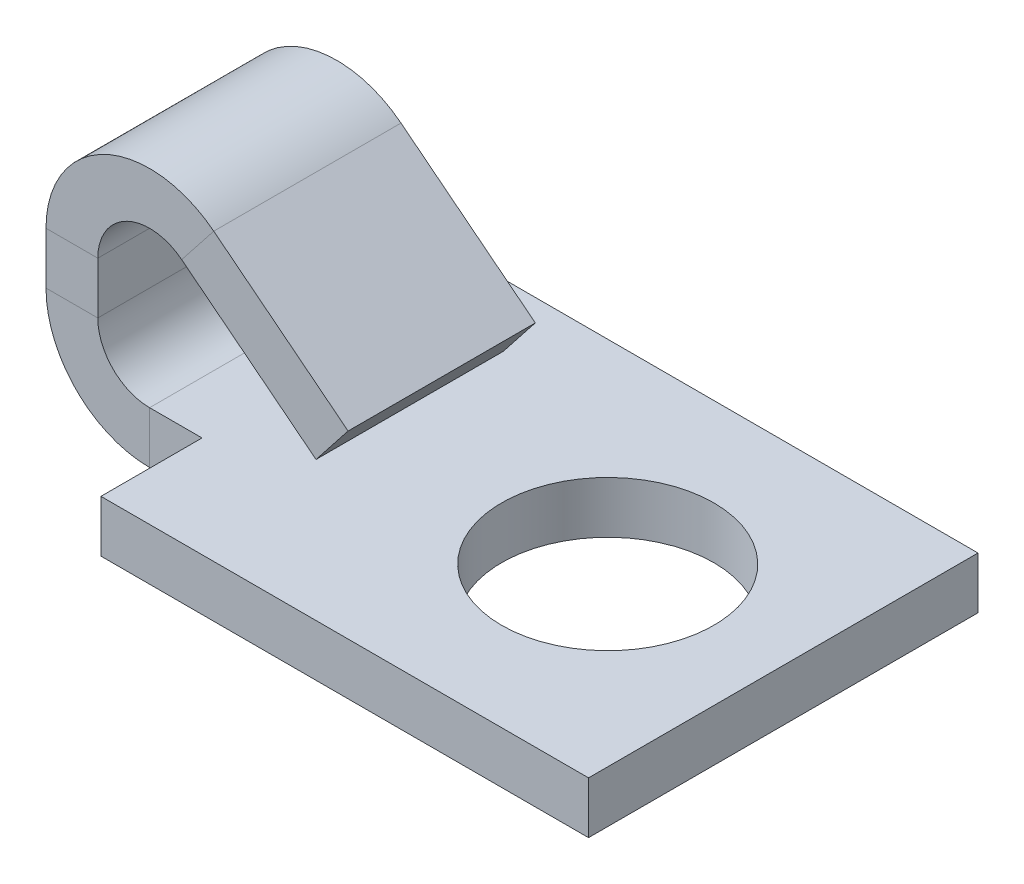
ISO-10303-21;
HEADER;
FILE_DESCRIPTION(('STEP AP214'),'2;1');
FILE_NAME('part.step','',(''),(''),'','','');
FILE_SCHEMA(('AUTOMOTIVE_DESIGN { 1 0 10303 214 1 1 1 1 }'));
ENDSEC;
DATA;
#1=APPLICATION_CONTEXT('core data for automotive mechanical design processes');
#2=APPLICATION_PROTOCOL_DEFINITION('international standard','automotive_design',2000,#1);
#3=PRODUCT_CONTEXT('',#1,'mechanical');
#4=PRODUCT('Part','Part','',(#3));
#5=PRODUCT_RELATED_PRODUCT_CATEGORY('part','',(#4));
#6=PRODUCT_DEFINITION_FORMATION('','',#4);
#7=PRODUCT_DEFINITION_CONTEXT('part definition',#1,'design');
#8=PRODUCT_DEFINITION('design','',#6,#7);
#9=PRODUCT_DEFINITION_SHAPE('','',#8);
#10=(LENGTH_UNIT() NAMED_UNIT(*) SI_UNIT(.MILLI.,.METRE.));
#11=(NAMED_UNIT(*) PLANE_ANGLE_UNIT() SI_UNIT($,.RADIAN.));
#12=(NAMED_UNIT(*) SI_UNIT($,.STERADIAN.) SOLID_ANGLE_UNIT());
#13=UNCERTAINTY_MEASURE_WITH_UNIT(LENGTH_MEASURE(1.E-05),#10,'distance_accuracy_value','');
#14=(GEOMETRIC_REPRESENTATION_CONTEXT(3) GLOBAL_UNCERTAINTY_ASSIGNED_CONTEXT((#13)) GLOBAL_UNIT_ASSIGNED_CONTEXT((#10,
#11,#12)) REPRESENTATION_CONTEXT('',''));
#15=CARTESIAN_POINT('',(0.,0.,0.));
#16=DIRECTION('',(0.,0.,1.));
#17=DIRECTION('',(1.,0.,0.));
#18=AXIS2_PLACEMENT_3D('',#15,#16,#17);
#19=CARTESIAN_POINT('',(19.05,0.,7.9248));
#20=DIRECTION('',(0.,-1.,0.));
#21=DIRECTION('',(0.,0.,-1.));
#22=AXIS2_PLACEMENT_3D('',#19,#20,#21);
#23=PLANE('',#22);
#24=DIRECTION('',(0.,0.,1.));
#25=VECTOR('',#24,1.);
#26=CARTESIAN_POINT('',(7.14375000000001,0.,-7.9248));
#27=LINE('',#26,#25);
#28=CARTESIAN_POINT('',(7.14375000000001,0.,-7.9248));
#29=VERTEX_POINT('',#28);
#30=CARTESIAN_POINT('',(7.14375000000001,0.,7.9248));
#31=VERTEX_POINT('',#30);
#32=EDGE_CURVE('E376',#29,#31,#27,.T.);
#33=ORIENTED_EDGE('',*,*,#32,.T.);
#34=DIRECTION('',(-1.,0.,0.));
#35=VECTOR('',#34,1.);
#36=CARTESIAN_POINT('',(19.05,0.,7.9248));
#37=LINE('',#36,#35);
#38=CARTESIAN_POINT('',(-12.7,0.,7.9248));
#39=VERTEX_POINT('',#38);
#40=EDGE_CURVE('E488',#31,#39,#37,.T.);
#41=ORIENTED_EDGE('',*,*,#40,.T.);
#42=DIRECTION('',(0.,0.,-1.));
#43=VECTOR('',#42,1.);
#44=CARTESIAN_POINT('',(-12.7,0.,7.9248));
#45=LINE('',#44,#43);
#46=CARTESIAN_POINT('',(-12.7,0.,3.81));
#47=VERTEX_POINT('',#46);
#48=EDGE_CURVE('E911',#39,#47,#45,.T.);
#49=ORIENTED_EDGE('',*,*,#48,.T.);
#50=DIRECTION('',(1.,0.,0.));
#51=VECTOR('',#50,1.);
#52=CARTESIAN_POINT('',(19.05,0.,3.81));
#53=LINE('',#52,#51);
#54=CARTESIAN_POINT('',(-14.8336,0.,3.81));
#55=VERTEX_POINT('',#54);
#56=EDGE_CURVE('E909',#47,#55,#53,.F.);
#57=ORIENTED_EDGE('',*,*,#56,.T.);
#58=DIRECTION('',(0.,0.,-1.));
#59=VECTOR('',#58,1.);
#60=CARTESIAN_POINT('',(-14.8336,0.,7.9248));
#61=LINE('',#60,#59);
#62=CARTESIAN_POINT('',(-14.8335999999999,0.,-3.81));
#63=VERTEX_POINT('',#62);
#64=EDGE_CURVE('E507',#55,#63,#61,.T.);
#65=ORIENTED_EDGE('',*,*,#64,.T.);
#66=DIRECTION('',(1.,0.,0.));
#67=VECTOR('',#66,1.);
#68=CARTESIAN_POINT('',(-14.8336,0.,-3.81));
#69=LINE('',#68,#67);
#70=CARTESIAN_POINT('',(-12.7,0.,-3.81000000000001));
#71=VERTEX_POINT('',#70);
#72=EDGE_CURVE('E907',#63,#71,#69,.T.);
#73=ORIENTED_EDGE('',*,*,#72,.T.);
#74=DIRECTION('',(0.,0.,-1.));
#75=VECTOR('',#74,1.);
#76=CARTESIAN_POINT('',(-12.7,0.,-7.9248));
#77=LINE('',#76,#75);
#78=CARTESIAN_POINT('',(-12.7,0.,-7.9248));
#79=VERTEX_POINT('',#78);
#80=EDGE_CURVE('E924',#71,#79,#77,.T.);
#81=ORIENTED_EDGE('',*,*,#80,.T.);
#82=DIRECTION('',(-1.,0.,0.));
#83=VECTOR('',#82,1.);
#84=CARTESIAN_POINT('',(19.05,0.,-7.9248));
#85=LINE('',#84,#83);
#86=EDGE_CURVE('E552',#29,#79,#85,.T.);
#87=ORIENTED_EDGE('',*,*,#86,.F.);
#88=EDGE_LOOP('',(#33,#41,#49,#57,#65,#73,#81,#87));
#89=FACE_BOUND('',#88,.T.);
#90=CARTESIAN_POINT('',(0.,0.,0.));
#91=DIRECTION('',(0.,1.,0.));
#92=DIRECTION('',(0.,0.,1.));
#93=AXIS2_PLACEMENT_3D('',#90,#91,#92);
#94=CIRCLE('',#93,4.318);
#95=CARTESIAN_POINT('',(0.,0.,4.318));
#96=VERTEX_POINT('',#95);
#97=EDGE_CURVE('E572',#96,#96,#94,.T.);
#98=ORIENTED_EDGE('',*,*,#97,.T.);
#99=EDGE_LOOP('',(#98));
#100=FACE_BOUND('',#99,.T.);
#101=ADVANCED_FACE('F361',(#89,#100),#23,.T.);
#102=CARTESIAN_POINT('',(19.05,2.10819999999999,7.9248));
#103=DIRECTION('',(0.,-1.,0.));
#104=DIRECTION('',(0.,0.,-1.));
#105=AXIS2_PLACEMENT_3D('',#102,#103,#104);
#106=PLANE('',#105);
#107=CARTESIAN_POINT('',(0.,2.10819999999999,0.));
#108=DIRECTION('',(0.,1.,0.));
#109=DIRECTION('',(0.,0.,1.));
#110=AXIS2_PLACEMENT_3D('',#107,#108,#109);
#111=CIRCLE('',#110,4.318);
#112=CARTESIAN_POINT('',(0.,2.10819999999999,4.318));
#113=VERTEX_POINT('',#112);
#114=EDGE_CURVE('E575',#113,#113,#111,.T.);
#115=ORIENTED_EDGE('',*,*,#114,.F.);
#116=EDGE_LOOP('',(#115));
#117=FACE_BOUND('',#116,.T.);
#118=DIRECTION('',(0.,0.,-1.));
#119=VECTOR('',#118,1.);
#120=CARTESIAN_POINT('',(-12.7,2.10819999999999,7.9248));
#121=LINE('',#120,#119);
#122=CARTESIAN_POINT('',(-12.7,2.10819999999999,7.9248));
#123=VERTEX_POINT('',#122);
#124=CARTESIAN_POINT('',(-12.7,2.10819999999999,3.81));
#125=VERTEX_POINT('',#124);
#126=EDGE_CURVE('E493',#123,#125,#121,.T.);
#127=ORIENTED_EDGE('',*,*,#126,.F.);
#128=DIRECTION('',(1.,0.,0.));
#129=VECTOR('',#128,1.);
#130=CARTESIAN_POINT('',(19.05,2.10819999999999,7.9248));
#131=LINE('',#130,#129);
#132=CARTESIAN_POINT('',(7.14375000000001,2.10819999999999,7.9248));
#133=VERTEX_POINT('',#132);
#134=EDGE_CURVE('E486',#133,#123,#131,.F.);
#135=ORIENTED_EDGE('',*,*,#134,.F.);
#136=DIRECTION('',(0.,0.,1.));
#137=VECTOR('',#136,1.);
#138=CARTESIAN_POINT('',(7.14375000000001,2.10819999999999,-7.9248));
#139=LINE('',#138,#137);
#140=CARTESIAN_POINT('',(7.14375000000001,2.10819999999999,-7.9248));
#141=VERTEX_POINT('',#140);
#142=EDGE_CURVE('E473',#141,#133,#139,.T.);
#143=ORIENTED_EDGE('',*,*,#142,.F.);
#144=DIRECTION('',(1.,0.,0.));
#145=VECTOR('',#144,1.);
#146=CARTESIAN_POINT('',(19.05,2.10819999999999,-7.9248));
#147=LINE('',#146,#145);
#148=CARTESIAN_POINT('',(-12.7,2.10819999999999,-7.9248));
#149=VERTEX_POINT('',#148);
#150=EDGE_CURVE('E497',#141,#149,#147,.F.);
#151=ORIENTED_EDGE('',*,*,#150,.T.);
#152=DIRECTION('',(0.,0.,-1.));
#153=VECTOR('',#152,1.);
#154=CARTESIAN_POINT('',(-12.7,2.10819999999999,7.9248));
#155=LINE('',#154,#153);
#156=CARTESIAN_POINT('',(-12.7,2.10819999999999,-3.81000000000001));
#157=VERTEX_POINT('',#156);
#158=EDGE_CURVE('E558',#157,#149,#155,.T.);
#159=ORIENTED_EDGE('',*,*,#158,.F.);
#160=DIRECTION('',(1.,0.,0.));
#161=VECTOR('',#160,1.);
#162=CARTESIAN_POINT('',(19.05,2.10819999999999,-3.81));
#163=LINE('',#162,#161);
#164=CARTESIAN_POINT('',(-14.8335999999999,2.10819999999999,-3.81));
#165=VERTEX_POINT('',#164);
#166=EDGE_CURVE('E569',#165,#157,#163,.T.);
#167=ORIENTED_EDGE('',*,*,#166,.F.);
#168=DIRECTION('',(0.,0.,-1.));
#169=VECTOR('',#168,1.);
#170=CARTESIAN_POINT('',(-14.8336,2.10819999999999,7.9248));
#171=LINE('',#170,#169);
#172=CARTESIAN_POINT('',(-14.8336,2.10819999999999,3.81));
#173=VERTEX_POINT('',#172);
#174=EDGE_CURVE('E504',#173,#165,#171,.T.);
#175=ORIENTED_EDGE('',*,*,#174,.F.);
#176=DIRECTION('',(-1.,0.,0.));
#177=VECTOR('',#176,1.);
#178=CARTESIAN_POINT('',(-14.8336,2.10819999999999,3.81000000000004));
#179=LINE('',#178,#177);
#180=EDGE_CURVE('E918',#125,#173,#179,.T.);
#181=ORIENTED_EDGE('',*,*,#180,.F.);
#182=EDGE_LOOP('',(#127,#135,#143,#151,#159,#167,#175,#181));
#183=FACE_BOUND('',#182,.T.);
#184=ADVANCED_FACE('F491',(#117,#183),#106,.F.);
#185=CARTESIAN_POINT('',(16.9418,4.21639999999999,7.9248));
#186=DIRECTION('',(0.,0.,1.));
#187=DIRECTION('',(1.,0.,0.));
#188=AXIS2_PLACEMENT_3D('',#185,#186,#187);
#189=PLANE('',#188);
#190=DIRECTION('',(0.,-1.,0.));
#191=VECTOR('',#190,1.);
#192=CARTESIAN_POINT('',(7.14375000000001,0.,7.9248));
#193=LINE('',#192,#191);
#194=EDGE_CURVE('E476',#133,#31,#193,.T.);
#195=ORIENTED_EDGE('',*,*,#194,.F.);
#196=ORIENTED_EDGE('',*,*,#134,.T.);
#197=DIRECTION('',(0.,1.,0.));
#198=VECTOR('',#197,1.);
#199=CARTESIAN_POINT('',(-12.7,2.10819999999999,7.9248));
#200=LINE('',#199,#198);
#201=EDGE_CURVE('E916',#123,#39,#200,.F.);
#202=ORIENTED_EDGE('',*,*,#201,.T.);
#203=ORIENTED_EDGE('',*,*,#40,.F.);
#204=EDGE_LOOP('',(#195,#196,#202,#203));
#205=FACE_BOUND('',#204,.T.);
#206=ADVANCED_FACE('F484',(#205),#189,.T.);
#207=CARTESIAN_POINT('',(-16.9418,4.21639999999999,-7.9248));
#208=DIRECTION('',(0.,0.,-1.));
#209=DIRECTION('',(-1.,0.,0.));
#210=AXIS2_PLACEMENT_3D('',#207,#208,#209);
#211=PLANE('',#210);
#212=DIRECTION('',(0.,-1.,0.));
#213=VECTOR('',#212,1.);
#214=CARTESIAN_POINT('',(7.14375000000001,0.,-7.9248));
#215=LINE('',#214,#213);
#216=EDGE_CURVE('E477',#141,#29,#215,.T.);
#217=ORIENTED_EDGE('',*,*,#216,.T.);
#218=ORIENTED_EDGE('',*,*,#86,.T.);
#219=DIRECTION('',(0.,-1.,0.));
#220=VECTOR('',#219,1.);
#221=CARTESIAN_POINT('',(-12.7,0.,-7.9248));
#222=LINE('',#221,#220);
#223=EDGE_CURVE('E565',#79,#149,#222,.F.);
#224=ORIENTED_EDGE('',*,*,#223,.T.);
#225=ORIENTED_EDGE('',*,*,#150,.F.);
#226=EDGE_LOOP('',(#217,#218,#224,#225));
#227=FACE_BOUND('',#226,.T.);
#228=ADVANCED_FACE('F363',(#227),#211,.T.);
#229=CARTESIAN_POINT('',(-20.355268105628,13.3616349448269,7.9248));
#230=DIRECTION('',(0.619138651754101,0.785281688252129,0.));
#231=DIRECTION('',(-0.785281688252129,0.619138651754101,0.));
#232=AXIS2_PLACEMENT_3D('',#229,#230,#231);
#233=PLANE('',#232);
#234=DIRECTION('',(-0.785281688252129,0.619138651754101,0.));
#235=VECTOR('',#234,1.);
#236=CARTESIAN_POINT('',(-20.355268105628,13.3616349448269,3.81));
#237=LINE('',#236,#235);
#238=CARTESIAN_POINT('',(-13.528331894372,7.97908223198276,3.81));
#239=VERTEX_POINT('',#238);
#240=CARTESIAN_POINT('',(-8.06166810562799,3.66900739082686,3.81));
#241=VERTEX_POINT('',#240);
#242=EDGE_CURVE('E594',#239,#241,#237,.F.);
#243=ORIENTED_EDGE('',*,*,#242,.F.);
#244=DIRECTION('',(0.,0.,-1.));
#245=VECTOR('',#244,1.);
#246=CARTESIAN_POINT('',(-13.528331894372,7.97908223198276,7.9248));
#247=LINE('',#246,#245);
#248=CARTESIAN_POINT('',(-13.528331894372,7.97908223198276,-3.81));
#249=VERTEX_POINT('',#248);
#250=EDGE_CURVE('E384',#239,#249,#247,.T.);
#251=ORIENTED_EDGE('',*,*,#250,.T.);
#252=DIRECTION('',(-0.785281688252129,0.619138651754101,0.));
#253=VECTOR('',#252,1.);
#254=CARTESIAN_POINT('',(-20.355268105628,13.3616349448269,-3.81));
#255=LINE('',#254,#253);
#256=CARTESIAN_POINT('',(-8.06166810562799,3.66900739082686,-3.81));
#257=VERTEX_POINT('',#256);
#258=EDGE_CURVE('E535',#257,#249,#255,.T.);
#259=ORIENTED_EDGE('',*,*,#258,.F.);
#260=DIRECTION('',(0.,0.,-1.));
#261=VECTOR('',#260,1.);
#262=CARTESIAN_POINT('',(-8.06166810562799,3.66900739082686,7.9248));
#263=LINE('',#262,#261);
#264=EDGE_CURVE('E11',#241,#257,#263,.T.);
#265=ORIENTED_EDGE('',*,*,#264,.F.);
#266=EDGE_LOOP('',(#243,#251,#259,#265));
#267=FACE_BOUND('',#266,.T.);
#268=ADVANCED_FACE('F664',(#267),#233,.F.);
#269=CARTESIAN_POINT('',(-6.7564,5.324538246,7.9248));
#270=DIRECTION('',(0.78528168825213,-0.6191386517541,0.));
#271=DIRECTION('',(0.6191386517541,0.78528168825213,0.));
#272=AXIS2_PLACEMENT_3D('',#269,#270,#271);
#273=PLANE('',#272);
#274=DIRECTION('',(0.,0.,-1.));
#275=VECTOR('',#274,1.);
#276=CARTESIAN_POINT('',(-6.7564,5.324538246,7.9248));
#277=LINE('',#276,#275);
#278=CARTESIAN_POINT('',(-6.7564,5.324538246,3.81));
#279=VERTEX_POINT('',#278);
#280=CARTESIAN_POINT('',(-6.75639999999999,5.32453824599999,-3.81000000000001));
#281=VERTEX_POINT('',#280);
#282=EDGE_CURVE('E369',#279,#281,#277,.T.);
#283=ORIENTED_EDGE('',*,*,#282,.F.);
#284=DIRECTION('',(0.619138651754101,0.785281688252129,0.));
#285=VECTOR('',#284,1.);
#286=CARTESIAN_POINT('',(-6.7564,5.324538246,3.81));
#287=LINE('',#286,#285);
#288=EDGE_CURVE('E597',#279,#241,#287,.F.);
#289=ORIENTED_EDGE('',*,*,#288,.T.);
#290=ORIENTED_EDGE('',*,*,#264,.T.);
#291=DIRECTION('',(-0.619138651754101,-0.785281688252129,0.));
#292=VECTOR('',#291,1.);
#293=CARTESIAN_POINT('',(-8.06166810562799,3.66900739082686,-3.81));
#294=LINE('',#293,#292);
#295=EDGE_CURVE('E533',#257,#281,#294,.F.);
#296=ORIENTED_EDGE('',*,*,#295,.T.);
#297=EDGE_LOOP('',(#283,#289,#290,#296));
#298=FACE_BOUND('',#297,.T.);
#299=ADVANCED_FACE('F537',(#298),#273,.T.);
#300=CARTESIAN_POINT('',(-19.05,15.0171658,7.9248));
#301=DIRECTION('',(0.619138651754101,0.785281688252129,0.));
#302=DIRECTION('',(-0.785281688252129,0.619138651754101,0.));
#303=AXIS2_PLACEMENT_3D('',#300,#301,#302);
#304=PLANE('',#303);
#305=DIRECTION('',(0.,0.,-1.));
#306=VECTOR('',#305,1.);
#307=CARTESIAN_POINT('',(-12.223063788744,9.6346130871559,7.9248));
#308=LINE('',#307,#306);
#309=CARTESIAN_POINT('',(-12.223063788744,9.6346130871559,3.81));
#310=VERTEX_POINT('',#309);
#311=CARTESIAN_POINT('',(-12.223063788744,9.63461308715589,-3.81));
#312=VERTEX_POINT('',#311);
#313=EDGE_CURVE('E514',#310,#312,#308,.T.);
#314=ORIENTED_EDGE('',*,*,#313,.F.);
#315=DIRECTION('',(0.785281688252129,-0.619138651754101,0.));
#316=VECTOR('',#315,1.);
#317=CARTESIAN_POINT('',(-19.05,15.0171658,3.81));
#318=LINE('',#317,#316);
#319=EDGE_CURVE('E524',#310,#279,#318,.T.);
#320=ORIENTED_EDGE('',*,*,#319,.T.);
#321=ORIENTED_EDGE('',*,*,#282,.T.);
#322=DIRECTION('',(-0.785281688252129,0.619138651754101,0.));
#323=VECTOR('',#322,1.);
#324=CARTESIAN_POINT('',(-19.05,15.0171658,-3.81000000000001));
#325=LINE('',#324,#323);
#326=EDGE_CURVE('E522',#281,#312,#325,.T.);
#327=ORIENTED_EDGE('',*,*,#326,.T.);
#328=EDGE_LOOP('',(#314,#320,#321,#327));
#329=FACE_BOUND('',#328,.T.);
#330=ADVANCED_FACE('F521',(#329),#304,.T.);
#331=CARTESIAN_POINT('',(-14.8336,6.32355137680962,7.9248));
#332=DIRECTION('',(0.,0.,-1.));
#333=DIRECTION('',(-1.,0.,0.));
#334=AXIS2_PLACEMENT_3D('',#331,#332,#333);
#335=CYLINDRICAL_SURFACE('',#334,4.2164);
#336=DIRECTION('',(0.,0.,-1.));
#337=VECTOR('',#336,1.);
#338=CARTESIAN_POINT('',(-19.05,6.32355137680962,7.9248));
#339=LINE('',#338,#337);
#340=CARTESIAN_POINT('',(-19.05,6.32355137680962,3.81));
#341=VERTEX_POINT('',#340);
#342=CARTESIAN_POINT('',(-19.05,6.32355137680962,-3.81));
#343=VERTEX_POINT('',#342);
#344=EDGE_CURVE('E512',#341,#343,#339,.T.);
#345=ORIENTED_EDGE('',*,*,#344,.F.);
#346=CARTESIAN_POINT('',(-14.8336,6.32355137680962,3.81));
#347=DIRECTION('',(0.,0.,1.));
#348=DIRECTION('',(1.,0.,0.));
#349=AXIS2_PLACEMENT_3D('',#346,#347,#348);
#350=CIRCLE('',#349,4.2164);
#351=EDGE_CURVE('E588',#341,#310,#350,.F.);
#352=ORIENTED_EDGE('',*,*,#351,.T.);
#353=ORIENTED_EDGE('',*,*,#313,.T.);
#354=CARTESIAN_POINT('',(-14.8336,6.32355137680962,-3.81));
#355=DIRECTION('',(0.,0.,-1.));
#356=DIRECTION('',(-1.,0.,0.));
#357=AXIS2_PLACEMENT_3D('',#354,#355,#356);
#358=CIRCLE('',#357,4.2164);
#359=EDGE_CURVE('E624',#312,#343,#358,.F.);
#360=ORIENTED_EDGE('',*,*,#359,.T.);
#361=EDGE_LOOP('',(#345,#352,#353,#360));
#362=FACE_BOUND('',#361,.T.);
#363=ADVANCED_FACE('F658',(#362),#335,.T.);
#364=CARTESIAN_POINT('',(-19.05,0.,7.9248));
#365=DIRECTION('',(-1.,0.,0.));
#366=DIRECTION('',(0.,0.,1.));
#367=AXIS2_PLACEMENT_3D('',#364,#365,#366);
#368=PLANE('',#367);
#369=DIRECTION('',(0.,0.,-1.));
#370=VECTOR('',#369,1.);
#371=CARTESIAN_POINT('',(-19.05,4.21639999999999,7.9248));
#372=LINE('',#371,#370);
#373=CARTESIAN_POINT('',(-19.05,4.21639999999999,3.81));
#374=VERTEX_POINT('',#373);
#375=CARTESIAN_POINT('',(-19.05,4.21639999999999,-3.81));
#376=VERTEX_POINT('',#375);
#377=EDGE_CURVE('E510',#374,#376,#372,.T.);
#378=ORIENTED_EDGE('',*,*,#377,.F.);
#379=DIRECTION('',(0.,-1.,0.));
#380=VECTOR('',#379,1.);
#381=CARTESIAN_POINT('',(-19.05,10.5399513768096,3.81));
#382=LINE('',#381,#380);
#383=EDGE_CURVE('E599',#341,#374,#382,.T.);
#384=ORIENTED_EDGE('',*,*,#383,.F.);
#385=ORIENTED_EDGE('',*,*,#344,.T.);
#386=DIRECTION('',(0.,-1.,0.));
#387=VECTOR('',#386,1.);
#388=CARTESIAN_POINT('',(-19.05,10.5399513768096,-3.81));
#389=LINE('',#388,#387);
#390=EDGE_CURVE('E540',#343,#376,#389,.T.);
#391=ORIENTED_EDGE('',*,*,#390,.T.);
#392=EDGE_LOOP('',(#378,#384,#385,#391));
#393=FACE_BOUND('',#392,.T.);
#394=ADVANCED_FACE('F654',(#393),#368,.T.);
#395=CARTESIAN_POINT('',(-14.8336,4.21639999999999,7.9248));
#396=DIRECTION('',(0.,0.,-1.));
#397=DIRECTION('',(-1.,0.,0.));
#398=AXIS2_PLACEMENT_3D('',#395,#396,#397);
#399=CYLINDRICAL_SURFACE('',#398,4.2164);
#400=ORIENTED_EDGE('',*,*,#64,.F.);
#401=CARTESIAN_POINT('',(-14.8336,4.21639999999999,3.81));
#402=DIRECTION('',(0.,0.,1.));
#403=DIRECTION('',(1.,0.,0.));
#404=AXIS2_PLACEMENT_3D('',#401,#402,#403);
#405=CIRCLE('',#404,4.2164);
#406=EDGE_CURVE('E583',#55,#374,#405,.F.);
#407=ORIENTED_EDGE('',*,*,#406,.T.);
#408=ORIENTED_EDGE('',*,*,#377,.T.);
#409=CARTESIAN_POINT('',(-14.8336,4.21639999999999,-3.81));
#410=DIRECTION('',(0.,0.,-1.));
#411=DIRECTION('',(-1.,0.,0.));
#412=AXIS2_PLACEMENT_3D('',#409,#410,#411);
#413=CIRCLE('',#412,4.2164);
#414=EDGE_CURVE('E615',#376,#63,#413,.F.);
#415=ORIENTED_EDGE('',*,*,#414,.T.);
#416=EDGE_LOOP('',(#400,#407,#408,#415));
#417=FACE_BOUND('',#416,.T.);
#418=ADVANCED_FACE('F686',(#417),#399,.T.);
#419=CARTESIAN_POINT('',(-14.8336,4.21639999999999,7.9248));
#420=DIRECTION('',(0.,0.,-1.));
#421=DIRECTION('',(-1.,0.,0.));
#422=AXIS2_PLACEMENT_3D('',#419,#420,#421);
#423=CYLINDRICAL_SURFACE('',#422,2.1082);
#424=CARTESIAN_POINT('',(-14.8336,4.21639999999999,3.81));
#425=DIRECTION('',(0.,0.,-1.));
#426=DIRECTION('',(-1.,0.,0.));
#427=AXIS2_PLACEMENT_3D('',#424,#425,#426);
#428=CIRCLE('',#427,2.1082);
#429=CARTESIAN_POINT('',(-16.9418,4.21639999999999,3.81));
#430=VERTEX_POINT('',#429);
#431=EDGE_CURVE('E586',#173,#430,#428,.T.);
#432=ORIENTED_EDGE('',*,*,#431,.F.);
#433=ORIENTED_EDGE('',*,*,#174,.T.);
#434=CARTESIAN_POINT('',(-14.8336,4.21639999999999,-3.81));
#435=DIRECTION('',(0.,0.,-1.));
#436=DIRECTION('',(-1.,0.,0.));
#437=AXIS2_PLACEMENT_3D('',#434,#435,#436);
#438=CIRCLE('',#437,2.1082);
#439=CARTESIAN_POINT('',(-16.9418,4.21639999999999,-3.81));
#440=VERTEX_POINT('',#439);
#441=EDGE_CURVE('E618',#440,#165,#438,.F.);
#442=ORIENTED_EDGE('',*,*,#441,.F.);
#443=DIRECTION('',(0.,0.,-1.));
#444=VECTOR('',#443,1.);
#445=CARTESIAN_POINT('',(-16.9418,4.21639999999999,7.9248));
#446=LINE('',#445,#444);
#447=EDGE_CURVE('E502',#430,#440,#446,.T.);
#448=ORIENTED_EDGE('',*,*,#447,.F.);
#449=EDGE_LOOP('',(#432,#433,#442,#448));
#450=FACE_BOUND('',#449,.T.);
#451=ADVANCED_FACE('F647',(#450),#423,.F.);
#452=CARTESIAN_POINT('',(-16.9418,0.,7.9248));
#453=DIRECTION('',(-1.,0.,0.));
#454=DIRECTION('',(0.,0.,1.));
#455=AXIS2_PLACEMENT_3D('',#452,#453,#454);
#456=PLANE('',#455);
#457=DIRECTION('',(0.,1.,0.));
#458=VECTOR('',#457,1.);
#459=CARTESIAN_POINT('',(-16.9418,0.,3.81));
#460=LINE('',#459,#458);
#461=CARTESIAN_POINT('',(-16.9418,6.32355137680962,3.81));
#462=VERTEX_POINT('',#461);
#463=EDGE_CURVE('E603',#462,#430,#460,.F.);
#464=ORIENTED_EDGE('',*,*,#463,.T.);
#465=ORIENTED_EDGE('',*,*,#447,.T.);
#466=DIRECTION('',(0.,1.,0.));
#467=VECTOR('',#466,1.);
#468=CARTESIAN_POINT('',(-16.9418,0.,-3.81));
#469=LINE('',#468,#467);
#470=CARTESIAN_POINT('',(-16.9418,6.32355137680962,-3.81));
#471=VERTEX_POINT('',#470);
#472=EDGE_CURVE('E545',#471,#440,#469,.F.);
#473=ORIENTED_EDGE('',*,*,#472,.F.);
#474=DIRECTION('',(0.,0.,-1.));
#475=VECTOR('',#474,1.);
#476=CARTESIAN_POINT('',(-16.9418,6.32355137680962,7.9248));
#477=LINE('',#476,#475);
#478=EDGE_CURVE('E495',#462,#471,#477,.T.);
#479=ORIENTED_EDGE('',*,*,#478,.F.);
#480=EDGE_LOOP('',(#464,#465,#473,#479));
#481=FACE_BOUND('',#480,.T.);
#482=ADVANCED_FACE('F642',(#481),#456,.F.);
#483=CARTESIAN_POINT('',(-14.8336,6.32355137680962,7.9248));
#484=DIRECTION('',(0.,0.,-1.));
#485=DIRECTION('',(-1.,0.,0.));
#486=AXIS2_PLACEMENT_3D('',#483,#484,#485);
#487=CYLINDRICAL_SURFACE('',#486,2.1082);
#488=CARTESIAN_POINT('',(-14.8336,6.32355137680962,3.81));
#489=DIRECTION('',(0.,0.,-1.));
#490=DIRECTION('',(-1.,0.,0.));
#491=AXIS2_PLACEMENT_3D('',#488,#489,#490);
#492=CIRCLE('',#491,2.1082);
#493=EDGE_CURVE('E591',#462,#239,#492,.T.);
#494=ORIENTED_EDGE('',*,*,#493,.F.);
#495=ORIENTED_EDGE('',*,*,#478,.T.);
#496=CARTESIAN_POINT('',(-14.8336,6.32355137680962,-3.81));
#497=DIRECTION('',(0.,0.,-1.));
#498=DIRECTION('',(-1.,0.,0.));
#499=AXIS2_PLACEMENT_3D('',#496,#497,#498);
#500=CIRCLE('',#499,2.1082);
#501=EDGE_CURVE('E621',#249,#471,#500,.F.);
#502=ORIENTED_EDGE('',*,*,#501,.F.);
#503=ORIENTED_EDGE('',*,*,#250,.F.);
#504=EDGE_LOOP('',(#494,#495,#502,#503));
#505=FACE_BOUND('',#504,.T.);
#506=ADVANCED_FACE('F630',(#505),#487,.F.);
#507=CARTESIAN_POINT('',(-19.05,10.5399513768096,-3.81));
#508=DIRECTION('',(0.,0.,-1.));
#509=DIRECTION('',(0.,-1.,0.));
#510=AXIS2_PLACEMENT_3D('',#507,#508,#509);
#511=PLANE('',#510);
#512=DIRECTION('',(-1.,0.,0.));
#513=VECTOR('',#512,1.);
#514=CARTESIAN_POINT('',(-19.05,4.21639999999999,-3.81));
#515=LINE('',#514,#513);
#516=EDGE_CURVE('E549',#376,#440,#515,.F.);
#517=ORIENTED_EDGE('',*,*,#516,.F.);
#518=ORIENTED_EDGE('',*,*,#390,.F.);
#519=DIRECTION('',(-1.,0.,0.));
#520=VECTOR('',#519,1.);
#521=CARTESIAN_POINT('',(-19.05,6.32355137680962,-3.81));
#522=LINE('',#521,#520);
#523=EDGE_CURVE('E548',#343,#471,#522,.F.);
#524=ORIENTED_EDGE('',*,*,#523,.T.);
#525=ORIENTED_EDGE('',*,*,#472,.T.);
#526=EDGE_LOOP('',(#517,#518,#524,#525));
#527=FACE_BOUND('',#526,.T.);
#528=ADVANCED_FACE('F640',(#527),#511,.T.);
#529=CARTESIAN_POINT('',(-20.355268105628,13.3616349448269,-3.81));
#530=DIRECTION('',(0.,0.,-1.));
#531=DIRECTION('',(-0.785281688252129,0.619138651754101,0.));
#532=AXIS2_PLACEMENT_3D('',#529,#530,#531);
#533=PLANE('',#532);
#534=ORIENTED_EDGE('',*,*,#258,.T.);
#535=DIRECTION('',(-0.619138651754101,-0.785281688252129,0.));
#536=VECTOR('',#535,1.);
#537=CARTESIAN_POINT('',(-13.528331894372,7.97908223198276,-3.81));
#538=LINE('',#537,#536);
#539=EDGE_CURVE('E534',#249,#312,#538,.F.);
#540=ORIENTED_EDGE('',*,*,#539,.T.);
#541=ORIENTED_EDGE('',*,*,#326,.F.);
#542=ORIENTED_EDGE('',*,*,#295,.F.);
#543=EDGE_LOOP('',(#534,#540,#541,#542));
#544=FACE_BOUND('',#543,.T.);
#545=ADVANCED_FACE('F532',(#544),#533,.T.);
#546=CARTESIAN_POINT('',(-14.8336,6.32355137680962,-3.81));
#547=DIRECTION('',(0.,0.,1.));
#548=DIRECTION('',(1.,0.,0.));
#549=AXIS2_PLACEMENT_3D('',#546,#547,#548);
#550=PLANE('',#549);
#551=ORIENTED_EDGE('',*,*,#501,.T.);
#552=ORIENTED_EDGE('',*,*,#523,.F.);
#553=ORIENTED_EDGE('',*,*,#359,.F.);
#554=ORIENTED_EDGE('',*,*,#539,.F.);
#555=EDGE_LOOP('',(#551,#552,#553,#554));
#556=FACE_BOUND('',#555,.T.);
#557=ADVANCED_FACE('F634',(#556),#550,.F.);
#558=CARTESIAN_POINT('',(-14.8336,4.21639999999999,-3.81));
#559=DIRECTION('',(0.,0.,1.));
#560=DIRECTION('',(1.,0.,0.));
#561=AXIS2_PLACEMENT_3D('',#558,#559,#560);
#562=PLANE('',#561);
#563=ORIENTED_EDGE('',*,*,#414,.F.);
#564=ORIENTED_EDGE('',*,*,#516,.T.);
#565=ORIENTED_EDGE('',*,*,#441,.T.);
#566=DIRECTION('',(0.,1.,0.));
#567=VECTOR('',#566,1.);
#568=CARTESIAN_POINT('',(-14.8336,2.10819999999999,-3.81));
#569=LINE('',#568,#567);
#570=EDGE_CURVE('E610',#165,#63,#569,.F.);
#571=ORIENTED_EDGE('',*,*,#570,.T.);
#572=EDGE_LOOP('',(#563,#564,#565,#571));
#573=FACE_BOUND('',#572,.T.);
#574=ADVANCED_FACE('F651',(#573),#562,.F.);
#575=CARTESIAN_POINT('',(-19.05,10.5399513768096,3.81));
#576=DIRECTION('',(0.,0.,-1.));
#577=DIRECTION('',(0.,-1.,0.));
#578=AXIS2_PLACEMENT_3D('',#575,#576,#577);
#579=PLANE('',#578);
#580=DIRECTION('',(-1.,0.,0.));
#581=VECTOR('',#580,1.);
#582=CARTESIAN_POINT('',(-19.05,6.32355137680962,3.81));
#583=LINE('',#582,#581);
#584=EDGE_CURVE('E607',#341,#462,#583,.F.);
#585=ORIENTED_EDGE('',*,*,#584,.F.);
#586=ORIENTED_EDGE('',*,*,#383,.T.);
#587=DIRECTION('',(-1.,0.,0.));
#588=VECTOR('',#587,1.);
#589=CARTESIAN_POINT('',(-19.05,4.21639999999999,3.81));
#590=LINE('',#589,#588);
#591=EDGE_CURVE('E606',#374,#430,#590,.F.);
#592=ORIENTED_EDGE('',*,*,#591,.T.);
#593=ORIENTED_EDGE('',*,*,#463,.F.);
#594=EDGE_LOOP('',(#585,#586,#592,#593));
#595=FACE_BOUND('',#594,.T.);
#596=ADVANCED_FACE('F755',(#595),#579,.F.);
#597=CARTESIAN_POINT('',(-19.05,15.0171658,3.81));
#598=DIRECTION('',(0.,0.,1.));
#599=DIRECTION('',(0.785281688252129,-0.619138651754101,0.));
#600=AXIS2_PLACEMENT_3D('',#597,#598,#599);
#601=PLANE('',#600);
#602=ORIENTED_EDGE('',*,*,#288,.F.);
#603=ORIENTED_EDGE('',*,*,#319,.F.);
#604=DIRECTION('',(0.619138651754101,0.785281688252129,0.));
#605=VECTOR('',#604,1.);
#606=CARTESIAN_POINT('',(-12.223063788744,9.6346130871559,3.81));
#607=LINE('',#606,#605);
#608=EDGE_CURVE('E596',#310,#239,#607,.F.);
#609=ORIENTED_EDGE('',*,*,#608,.T.);
#610=ORIENTED_EDGE('',*,*,#242,.T.);
#611=EDGE_LOOP('',(#602,#603,#609,#610));
#612=FACE_BOUND('',#611,.T.);
#613=ADVANCED_FACE('F663',(#612),#601,.T.);
#614=CARTESIAN_POINT('',(-14.8336,6.32355137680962,3.81));
#615=DIRECTION('',(0.,0.,-1.));
#616=DIRECTION('',(-1.,0.,0.));
#617=AXIS2_PLACEMENT_3D('',#614,#615,#616);
#618=PLANE('',#617);
#619=ORIENTED_EDGE('',*,*,#608,.F.);
#620=ORIENTED_EDGE('',*,*,#351,.F.);
#621=ORIENTED_EDGE('',*,*,#584,.T.);
#622=ORIENTED_EDGE('',*,*,#493,.T.);
#623=EDGE_LOOP('',(#619,#620,#621,#622));
#624=FACE_BOUND('',#623,.T.);
#625=ADVANCED_FACE('F661',(#624),#618,.F.);
#626=CARTESIAN_POINT('',(-14.8336,4.21639999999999,3.81));
#627=DIRECTION('',(0.,0.,-1.));
#628=DIRECTION('',(-1.,0.,0.));
#629=AXIS2_PLACEMENT_3D('',#626,#627,#628);
#630=PLANE('',#629);
#631=ORIENTED_EDGE('',*,*,#591,.F.);
#632=ORIENTED_EDGE('',*,*,#406,.F.);
#633=DIRECTION('',(0.,1.,0.));
#634=VECTOR('',#633,1.);
#635=CARTESIAN_POINT('',(-14.8336,2.10819999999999,3.81));
#636=LINE('',#635,#634);
#637=EDGE_CURVE('E581',#173,#55,#636,.F.);
#638=ORIENTED_EDGE('',*,*,#637,.F.);
#639=ORIENTED_EDGE('',*,*,#431,.T.);
#640=EDGE_LOOP('',(#631,#632,#638,#639));
#641=FACE_BOUND('',#640,.T.);
#642=ADVANCED_FACE('F795',(#641),#630,.F.);
#643=CARTESIAN_POINT('',(0.,0.,0.));
#644=DIRECTION('',(0.,1.,0.));
#645=DIRECTION('',(0.,0.,1.));
#646=AXIS2_PLACEMENT_3D('',#643,#644,#645);
#647=CYLINDRICAL_SURFACE('',#646,4.318);
#648=ORIENTED_EDGE('',*,*,#114,.T.);
#649=EDGE_LOOP('',(#648));
#650=FACE_BOUND('',#649,.T.);
#651=ORIENTED_EDGE('',*,*,#97,.F.);
#652=EDGE_LOOP('',(#651));
#653=FACE_BOUND('',#652,.T.);
#654=ADVANCED_FACE('F790',(#650,#653),#647,.F.);
#655=CARTESIAN_POINT('',(-12.7,0.,-7.9248));
#656=DIRECTION('',(-1.,0.,0.));
#657=DIRECTION('',(0.,0.,-1.));
#658=AXIS2_PLACEMENT_3D('',#655,#656,#657);
#659=PLANE('',#658);
#660=ORIENTED_EDGE('',*,*,#223,.F.);
#661=ORIENTED_EDGE('',*,*,#80,.F.);
#662=DIRECTION('',(0.,-1.,0.));
#663=VECTOR('',#662,1.);
#664=CARTESIAN_POINT('',(-12.7,0.,-3.81000000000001));
#665=LINE('',#664,#663);
#666=EDGE_CURVE('E568',#71,#157,#665,.F.);
#667=ORIENTED_EDGE('',*,*,#666,.T.);
#668=ORIENTED_EDGE('',*,*,#158,.T.);
#669=EDGE_LOOP('',(#660,#661,#667,#668));
#670=FACE_BOUND('',#669,.T.);
#671=ADVANCED_FACE('F564',(#670),#659,.T.);
#672=CARTESIAN_POINT('',(-14.8336,0.,-3.81));
#673=DIRECTION('',(0.,0.,-1.));
#674=DIRECTION('',(1.,0.,0.));
#675=AXIS2_PLACEMENT_3D('',#672,#673,#674);
#676=PLANE('',#675);
#677=ORIENTED_EDGE('',*,*,#666,.F.);
#678=ORIENTED_EDGE('',*,*,#72,.F.);
#679=ORIENTED_EDGE('',*,*,#570,.F.);
#680=ORIENTED_EDGE('',*,*,#166,.T.);
#681=EDGE_LOOP('',(#677,#678,#679,#680));
#682=FACE_BOUND('',#681,.T.);
#683=ADVANCED_FACE('F806',(#682),#676,.T.);
#684=CARTESIAN_POINT('',(-12.7,2.10819999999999,7.9248));
#685=DIRECTION('',(-1.,0.,0.));
#686=DIRECTION('',(0.,0.,-1.));
#687=AXIS2_PLACEMENT_3D('',#684,#685,#686);
#688=PLANE('',#687);
#689=ORIENTED_EDGE('',*,*,#201,.F.);
#690=ORIENTED_EDGE('',*,*,#126,.T.);
#691=DIRECTION('',(0.,1.,0.));
#692=VECTOR('',#691,1.);
#693=CARTESIAN_POINT('',(-12.7,2.10819999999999,3.81));
#694=LINE('',#693,#692);
#695=EDGE_CURVE('E914',#125,#47,#694,.F.);
#696=ORIENTED_EDGE('',*,*,#695,.T.);
#697=ORIENTED_EDGE('',*,*,#48,.F.);
#698=EDGE_LOOP('',(#689,#690,#696,#697));
#699=FACE_BOUND('',#698,.T.);
#700=ADVANCED_FACE('F815',(#699),#688,.T.);
#701=CARTESIAN_POINT('',(-14.8336,2.10819999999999,3.81000000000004));
#702=DIRECTION('',(0.,0.,1.));
#703=DIRECTION('',(-1.,0.,0.));
#704=AXIS2_PLACEMENT_3D('',#701,#702,#703);
#705=PLANE('',#704);
#706=ORIENTED_EDGE('',*,*,#180,.T.);
#707=ORIENTED_EDGE('',*,*,#637,.T.);
#708=ORIENTED_EDGE('',*,*,#56,.F.);
#709=ORIENTED_EDGE('',*,*,#695,.F.);
#710=EDGE_LOOP('',(#706,#707,#708,#709));
#711=FACE_BOUND('',#710,.T.);
#712=ADVANCED_FACE('F828',(#711),#705,.T.);
#713=CARTESIAN_POINT('',(7.14375000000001,0.,-7.9248));
#714=DIRECTION('',(-1.,0.,0.));
#715=DIRECTION('',(0.,0.,1.));
#716=AXIS2_PLACEMENT_3D('',#713,#714,#715);
#717=PLANE('',#716);
#718=ORIENTED_EDGE('',*,*,#194,.T.);
#719=ORIENTED_EDGE('',*,*,#32,.F.);
#720=ORIENTED_EDGE('',*,*,#216,.F.);
#721=ORIENTED_EDGE('',*,*,#142,.T.);
#722=EDGE_LOOP('',(#718,#719,#720,#721));
#723=FACE_BOUND('',#722,.T.);
#724=ADVANCED_FACE('F475',(#723),#717,.F.);
#725=CLOSED_SHELL('',(#101,#184,#206,#228,#268,#299,#330,#363,#394,#418,#451,#482,#506,#528,
#545,#557,#574,#596,#613,#625,#642,#654,#671,#683,#700,#712,#724));
#726=MANIFOLD_SOLID_BREP('B2',#725);
#727=ADVANCED_BREP_SHAPE_REPRESENTATION('',(#18,#726),#14);
#728=SHAPE_DEFINITION_REPRESENTATION(#9,#727);
ENDSEC;
END-ISO-10303-21;
